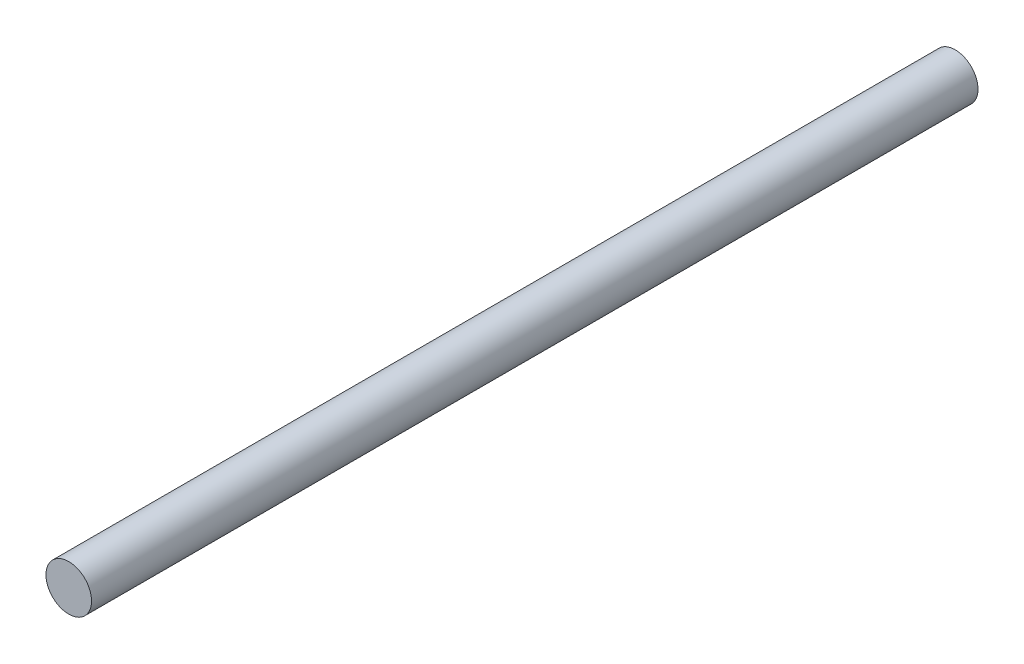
from build123d import *

# Parameters (mm, degrees)
SKETCH1_R          = 4.572
BASE_EXTRUDE_DEPTH = 88.9


with BuildPart() as part:
    # Sketch1 → Base Extrude (new, symmetric)
    with BuildSketch(Plane.XY):
        Circle(SKETCH1_R)
    extrude(amount=BASE_EXTRUDE_DEPTH, both=True)


solid = part.part
